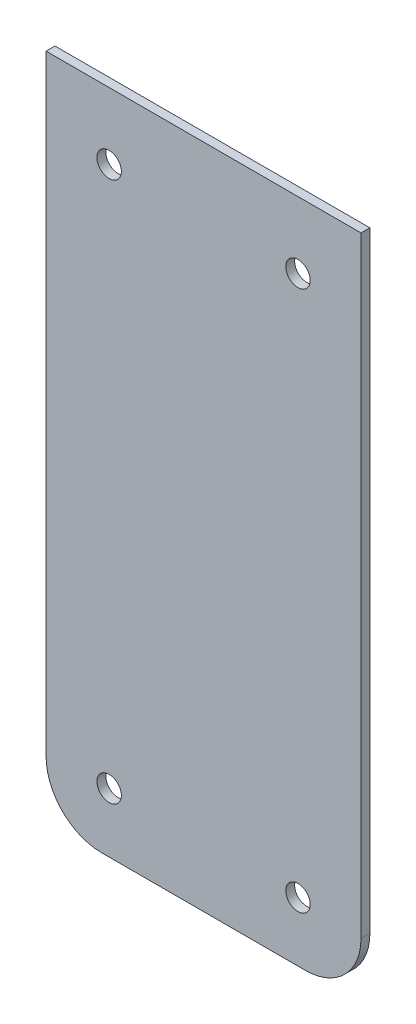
from build123d import *

# Parameters (mm, degrees)
EXTRUDE1_DEPTH     = 1.6
SKETCH2_R          = 2.2
CUT_EXTRUDE1_DEPTH = 67.37983504


with BuildPart() as part:
    # Sketch1 → Extrude1 (new body)
    with BuildSketch(Plane.XY):
        with BuildLine():
            Line((28.35, 60), (-28.35, 60))
            Line((-28.35, 60), (-28.35, -50))
            ThreePointArc((-28.35, -50), (-25.421067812, -57.071067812), (-18.35, -60))
            Line((-18.35, -60), (18.35, -60))
            ThreePointArc((18.35, -60), (25.421067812, -57.071067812), (28.35, -50))
            Line((28.35, -50), (28.35, 60))
        make_face()
    extrude(amount=EXTRUDE1_DEPTH)

    # Sketch2 → Cut-Extrude1 (cut, through all)
    with BuildSketch(Plane.XY.offset(1.6)):
        with Locations((-17, 48)):
            Circle(SKETCH2_R)
        with Locations((17, 48)):
            Circle(SKETCH2_R)
        with Locations((-17, -49.3)):
            Circle(SKETCH2_R)
        with Locations((17, -49.3)):
            Circle(SKETCH2_R)
    extrude(amount=-CUT_EXTRUDE1_DEPTH, mode=Mode.SUBTRACT)


solid = part.part
